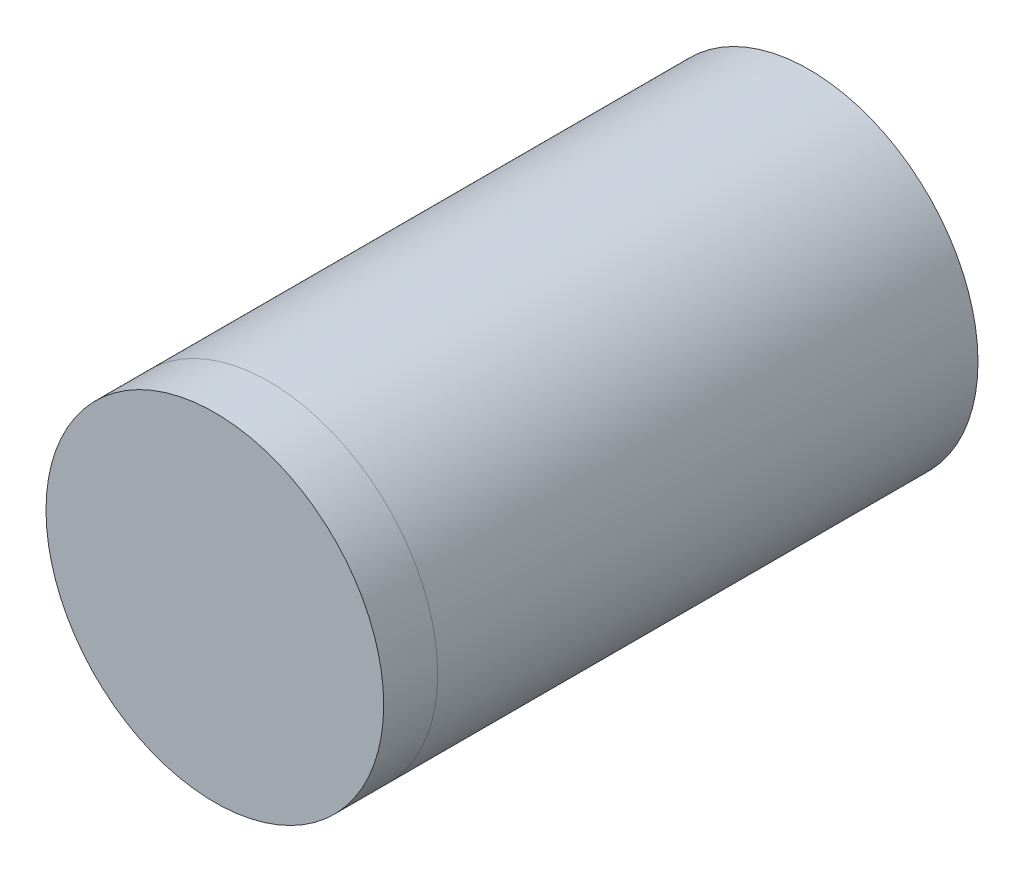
ISO-10303-21;
HEADER;
FILE_DESCRIPTION(('STEP AP214'),'2;1');
FILE_NAME('part.step','',(''),(''),'','','');
FILE_SCHEMA(('AUTOMOTIVE_DESIGN { 1 0 10303 214 1 1 1 1 }'));
ENDSEC;
DATA;
#1=APPLICATION_CONTEXT('core data for automotive mechanical design processes');
#2=APPLICATION_PROTOCOL_DEFINITION('international standard','automotive_design',2000,#1);
#3=PRODUCT_CONTEXT('',#1,'mechanical');
#4=PRODUCT('Part','Part','',(#3));
#5=PRODUCT_RELATED_PRODUCT_CATEGORY('part','',(#4));
#6=PRODUCT_DEFINITION_FORMATION('','',#4);
#7=PRODUCT_DEFINITION_CONTEXT('part definition',#1,'design');
#8=PRODUCT_DEFINITION('design','',#6,#7);
#9=PRODUCT_DEFINITION_SHAPE('','',#8);
#10=(LENGTH_UNIT() NAMED_UNIT(*) SI_UNIT(.MILLI.,.METRE.));
#11=(NAMED_UNIT(*) PLANE_ANGLE_UNIT() SI_UNIT($,.RADIAN.));
#12=(NAMED_UNIT(*) SI_UNIT($,.STERADIAN.) SOLID_ANGLE_UNIT());
#13=UNCERTAINTY_MEASURE_WITH_UNIT(LENGTH_MEASURE(1.E-05),#10,'distance_accuracy_value','');
#14=(GEOMETRIC_REPRESENTATION_CONTEXT(3) GLOBAL_UNCERTAINTY_ASSIGNED_CONTEXT((#13)) GLOBAL_UNIT_ASSIGNED_CONTEXT((#10,
#11,#12)) REPRESENTATION_CONTEXT('',''));
#15=CARTESIAN_POINT('',(0.,0.,0.));
#16=DIRECTION('',(0.,0.,1.));
#17=DIRECTION('',(1.,0.,0.));
#18=AXIS2_PLACEMENT_3D('',#15,#16,#17);
#19=CARTESIAN_POINT('',(0.,0.,35.199));
#20=DIRECTION('',(0.,0.,-1.));
#21=DIRECTION('',(-1.,0.,0.));
#22=AXIS2_PLACEMENT_3D('',#19,#20,#21);
#23=PLANE('',#22);
#24=CARTESIAN_POINT('',(0.,0.,35.199));
#25=DIRECTION('',(0.,0.,-1.));
#26=DIRECTION('',(-1.,0.,0.));
#27=AXIS2_PLACEMENT_3D('',#24,#25,#26);
#28=CIRCLE('',#27,10.0005);
#29=CARTESIAN_POINT('',(-10.0005,0.,35.199));
#30=VERTEX_POINT('',#29);
#31=EDGE_CURVE('E10',#30,#30,#28,.T.);
#32=ORIENTED_EDGE('',*,*,#31,.F.);
#33=EDGE_LOOP('',(#32));
#34=FACE_BOUND('',#33,.T.);
#35=ADVANCED_FACE('F30',(#34),#23,.F.);
#36=CARTESIAN_POINT('',(0.,0.,0.));
#37=DIRECTION('',(0.,0.,-1.));
#38=DIRECTION('',(-1.,0.,0.));
#39=AXIS2_PLACEMENT_3D('',#36,#37,#38);
#40=CYLINDRICAL_SURFACE('',#39,10.0005);
#41=CARTESIAN_POINT('',(0.,0.,31.999));
#42=DIRECTION('',(0.,0.,-1.));
#43=DIRECTION('',(-1.,0.,0.));
#44=AXIS2_PLACEMENT_3D('',#41,#42,#43);
#45=CIRCLE('',#44,10.);
#46=CARTESIAN_POINT('',(-9.99999999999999,0.,31.999));
#47=VERTEX_POINT('',#46);
#48=EDGE_CURVE('E38',#47,#47,#45,.T.);
#49=ORIENTED_EDGE('',*,*,#48,.F.);
#50=EDGE_LOOP('',(#49));
#51=FACE_BOUND('',#50,.T.);
#52=ORIENTED_EDGE('',*,*,#31,.T.);
#53=EDGE_LOOP('',(#52));
#54=FACE_BOUND('',#53,.T.);
#55=ADVANCED_FACE('F51',(#51,#54),#40,.T.);
#56=CARTESIAN_POINT('',(0.,0.,-0.00100000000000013));
#57=DIRECTION('',(0.,0.,-1.));
#58=DIRECTION('',(-1.,0.,0.));
#59=AXIS2_PLACEMENT_3D('',#56,#57,#58);
#60=CYLINDRICAL_SURFACE('',#59,10.);
#61=CARTESIAN_POINT('',(0.,0.,-0.000999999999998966));
#62=DIRECTION('',(0.,0.,-1.));
#63=DIRECTION('',(-1.,0.,0.));
#64=AXIS2_PLACEMENT_3D('',#61,#62,#63);
#65=CIRCLE('',#64,10.);
#66=CARTESIAN_POINT('',(-10.,0.,-0.000999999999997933));
#67=VERTEX_POINT('',#66);
#68=EDGE_CURVE('E43',#67,#67,#65,.T.);
#69=ORIENTED_EDGE('',*,*,#68,.F.);
#70=EDGE_LOOP('',(#69));
#71=FACE_BOUND('',#70,.T.);
#72=ORIENTED_EDGE('',*,*,#48,.T.);
#73=EDGE_LOOP('',(#72));
#74=FACE_BOUND('',#73,.T.);
#75=ADVANCED_FACE('F53',(#71,#74),#60,.T.);
#76=CARTESIAN_POINT('',(0.,0.,-0.00099999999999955));
#77=DIRECTION('',(0.,0.,1.));
#78=DIRECTION('',(1.,0.,0.));
#79=AXIS2_PLACEMENT_3D('',#76,#77,#78);
#80=PLANE('',#79);
#81=ORIENTED_EDGE('',*,*,#68,.T.);
#82=EDGE_LOOP('',(#81));
#83=FACE_BOUND('',#82,.T.);
#84=ADVANCED_FACE('F58',(#83),#80,.F.);
#85=CLOSED_SHELL('',(#35,#55,#75,#84));
#86=MANIFOLD_SOLID_BREP('B2',#85);
#87=ADVANCED_BREP_SHAPE_REPRESENTATION('',(#18,#86),#14);
#88=SHAPE_DEFINITION_REPRESENTATION(#9,#87);
ENDSEC;
END-ISO-10303-21;
